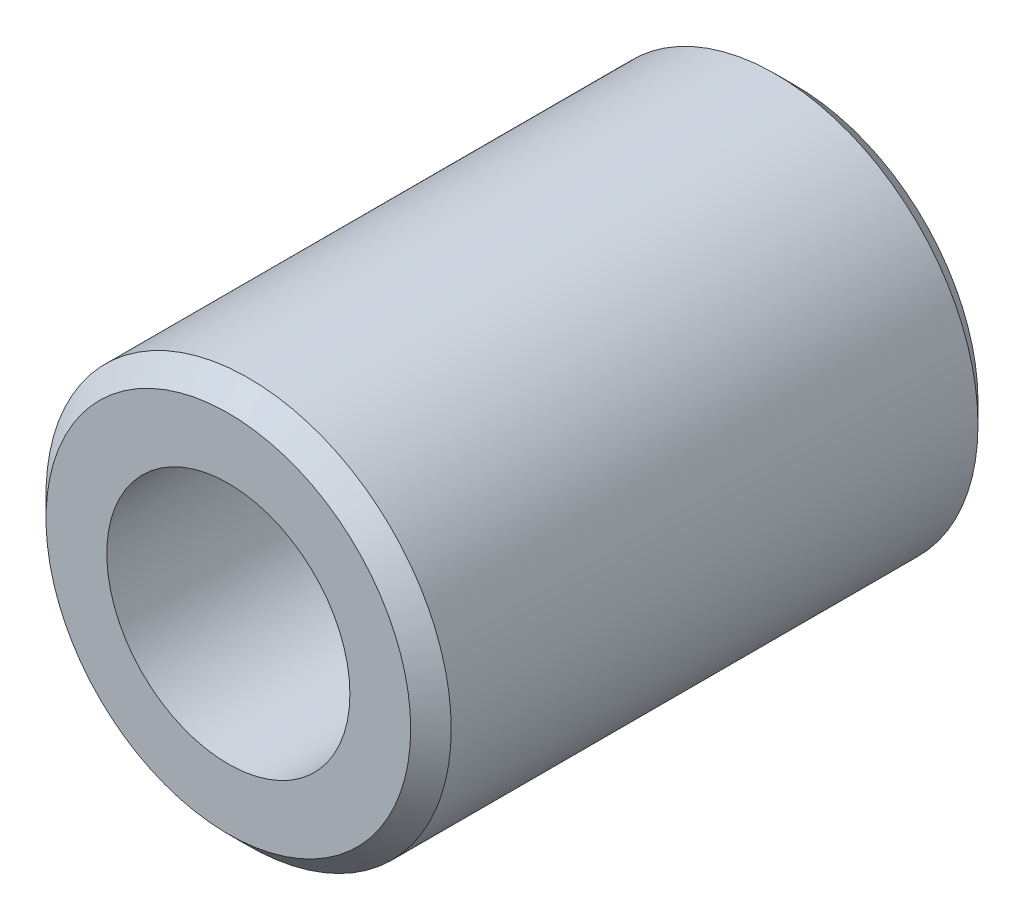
ISO-10303-21;
HEADER;
FILE_DESCRIPTION(('STEP AP214'),'2;1');
FILE_NAME('part.step','',(''),(''),'','','');
FILE_SCHEMA(('AUTOMOTIVE_DESIGN { 1 0 10303 214 1 1 1 1 }'));
ENDSEC;
DATA;
#1=APPLICATION_CONTEXT('core data for automotive mechanical design processes');
#2=APPLICATION_PROTOCOL_DEFINITION('international standard','automotive_design',2000,#1);
#3=PRODUCT_CONTEXT('',#1,'mechanical');
#4=PRODUCT('Part','Part','',(#3));
#5=PRODUCT_RELATED_PRODUCT_CATEGORY('part','',(#4));
#6=PRODUCT_DEFINITION_FORMATION('','',#4);
#7=PRODUCT_DEFINITION_CONTEXT('part definition',#1,'design');
#8=PRODUCT_DEFINITION('design','',#6,#7);
#9=PRODUCT_DEFINITION_SHAPE('','',#8);
#10=(LENGTH_UNIT() NAMED_UNIT(*) SI_UNIT(.MILLI.,.METRE.));
#11=(NAMED_UNIT(*) PLANE_ANGLE_UNIT() SI_UNIT($,.RADIAN.));
#12=(NAMED_UNIT(*) SI_UNIT($,.STERADIAN.) SOLID_ANGLE_UNIT());
#13=UNCERTAINTY_MEASURE_WITH_UNIT(LENGTH_MEASURE(1.E-05),#10,'distance_accuracy_value','');
#14=(GEOMETRIC_REPRESENTATION_CONTEXT(3) GLOBAL_UNCERTAINTY_ASSIGNED_CONTEXT((#13)) GLOBAL_UNIT_ASSIGNED_CONTEXT((#10,
#11,#12)) REPRESENTATION_CONTEXT('',''));
#15=CARTESIAN_POINT('',(0.,0.,0.));
#16=DIRECTION('',(0.,0.,1.));
#17=DIRECTION('',(1.,0.,0.));
#18=AXIS2_PLACEMENT_3D('',#15,#16,#17);
#19=CARTESIAN_POINT('',(-14.75,36.,3.5));
#20=DIRECTION('',(0.,0.,1.));
#21=DIRECTION('',(1.,0.,0.));
#22=AXIS2_PLACEMENT_3D('',#19,#20,#21);
#23=PLANE('',#22);
#24=CARTESIAN_POINT('',(-14.75,36.,3.5));
#25=DIRECTION('',(0.,0.,1.));
#26=DIRECTION('',(1.,0.,0.));
#27=AXIS2_PLACEMENT_3D('',#24,#25,#26);
#28=CIRCLE('',#27,2.25);
#29=CARTESIAN_POINT('',(-12.5,36.,3.5));
#30=VERTEX_POINT('',#29);
#31=EDGE_CURVE('E43',#30,#30,#28,.T.);
#32=ORIENTED_EDGE('',*,*,#31,.T.);
#33=EDGE_LOOP('',(#32));
#34=FACE_BOUND('',#33,.T.);
#35=CARTESIAN_POINT('',(-14.75,36.,3.5));
#36=DIRECTION('',(0.,0.,1.));
#37=DIRECTION('',(1.,0.,0.));
#38=AXIS2_PLACEMENT_3D('',#35,#36,#37);
#39=CIRCLE('',#38,1.5);
#40=CARTESIAN_POINT('',(-13.25,36.,3.5));
#41=VERTEX_POINT('',#40);
#42=EDGE_CURVE('E48',#41,#41,#39,.T.);
#43=ORIENTED_EDGE('',*,*,#42,.F.);
#44=EDGE_LOOP('',(#43));
#45=FACE_BOUND('',#44,.T.);
#46=ADVANCED_FACE('F28',(#34,#45),#23,.T.);
#47=CARTESIAN_POINT('',(-14.75,36.,3.5));
#48=DIRECTION('',(0.,0.,-1.));
#49=DIRECTION('',(-1.,0.,0.));
#50=AXIS2_PLACEMENT_3D('',#47,#48,#49);
#51=CYLINDRICAL_SURFACE('',#50,2.5);
#52=CARTESIAN_POINT('',(-14.75,36.,3.25));
#53=DIRECTION('',(0.,0.,1.));
#54=DIRECTION('',(1.,0.,0.));
#55=AXIS2_PLACEMENT_3D('',#52,#53,#54);
#56=CIRCLE('',#55,2.5);
#57=CARTESIAN_POINT('',(-12.25,36.,3.25));
#58=VERTEX_POINT('',#57);
#59=EDGE_CURVE('E35',#58,#58,#56,.F.);
#60=ORIENTED_EDGE('',*,*,#59,.T.);
#61=EDGE_LOOP('',(#60));
#62=FACE_BOUND('',#61,.T.);
#63=CARTESIAN_POINT('',(-14.75,36.,-3.25));
#64=DIRECTION('',(0.,0.,1.));
#65=DIRECTION('',(1.,0.,0.));
#66=AXIS2_PLACEMENT_3D('',#63,#64,#65);
#67=CIRCLE('',#66,2.5);
#68=CARTESIAN_POINT('',(-12.25,36.,-3.25));
#69=VERTEX_POINT('',#68);
#70=EDGE_CURVE('E39',#69,#69,#67,.T.);
#71=ORIENTED_EDGE('',*,*,#70,.T.);
#72=EDGE_LOOP('',(#71));
#73=FACE_BOUND('',#72,.T.);
#74=ADVANCED_FACE('F30',(#62,#73),#51,.T.);
#75=CARTESIAN_POINT('',(-14.75,36.,3.5));
#76=DIRECTION('',(0.,0.,-1.));
#77=DIRECTION('',(-1.,0.,0.));
#78=AXIS2_PLACEMENT_3D('',#75,#76,#77);
#79=CYLINDRICAL_SURFACE('',#78,1.5);
#80=ORIENTED_EDGE('',*,*,#42,.T.);
#81=EDGE_LOOP('',(#80));
#82=FACE_BOUND('',#81,.T.);
#83=CARTESIAN_POINT('',(-14.75,36.,-3.5));
#84=DIRECTION('',(0.,0.,1.));
#85=DIRECTION('',(1.,0.,0.));
#86=AXIS2_PLACEMENT_3D('',#83,#84,#85);
#87=CIRCLE('',#86,1.5);
#88=CARTESIAN_POINT('',(-13.25,36.,-3.5));
#89=VERTEX_POINT('',#88);
#90=EDGE_CURVE('E51',#89,#89,#87,.T.);
#91=ORIENTED_EDGE('',*,*,#90,.F.);
#92=EDGE_LOOP('',(#91));
#93=FACE_BOUND('',#92,.T.);
#94=ADVANCED_FACE('F57',(#82,#93),#79,.F.);
#95=CARTESIAN_POINT('',(-14.75,36.,-3.5));
#96=DIRECTION('',(0.,0.,1.));
#97=DIRECTION('',(1.,0.,0.));
#98=AXIS2_PLACEMENT_3D('',#95,#96,#97);
#99=PLANE('',#98);
#100=CARTESIAN_POINT('',(-14.75,36.,-3.5));
#101=DIRECTION('',(0.,0.,1.));
#102=DIRECTION('',(1.,0.,0.));
#103=AXIS2_PLACEMENT_3D('',#100,#101,#102);
#104=CIRCLE('',#103,2.25);
#105=CARTESIAN_POINT('',(-12.5,36.,-3.5));
#106=VERTEX_POINT('',#105);
#107=EDGE_CURVE('E10',#106,#106,#104,.F.);
#108=ORIENTED_EDGE('',*,*,#107,.T.);
#109=EDGE_LOOP('',(#108));
#110=FACE_BOUND('',#109,.T.);
#111=ORIENTED_EDGE('',*,*,#90,.T.);
#112=EDGE_LOOP('',(#111));
#113=FACE_BOUND('',#112,.T.);
#114=ADVANCED_FACE('F55',(#110,#113),#99,.F.);
#115=CARTESIAN_POINT('',(-14.75,36.,3.5));
#116=DIRECTION('',(0.,0.,-1.));
#117=DIRECTION('',(-1.,0.,0.));
#118=AXIS2_PLACEMENT_3D('',#115,#116,#117);
#119=CONICAL_SURFACE('',#118,2.25,0.785398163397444);
#120=ORIENTED_EDGE('',*,*,#59,.F.);
#121=EDGE_LOOP('',(#120));
#122=FACE_BOUND('',#121,.T.);
#123=ORIENTED_EDGE('',*,*,#31,.F.);
#124=EDGE_LOOP('',(#123));
#125=FACE_BOUND('',#124,.T.);
#126=ADVANCED_FACE('F65',(#122,#125),#119,.T.);
#127=CARTESIAN_POINT('',(-14.75,36.,-3.25));
#128=DIRECTION('',(0.,0.,1.));
#129=DIRECTION('',(1.,0.,0.));
#130=AXIS2_PLACEMENT_3D('',#127,#128,#129);
#131=CONICAL_SURFACE('',#130,2.5,0.785398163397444);
#132=ORIENTED_EDGE('',*,*,#107,.F.);
#133=EDGE_LOOP('',(#132));
#134=FACE_BOUND('',#133,.T.);
#135=ORIENTED_EDGE('',*,*,#70,.F.);
#136=EDGE_LOOP('',(#135));
#137=FACE_BOUND('',#136,.T.);
#138=ADVANCED_FACE('F76',(#134,#137),#131,.T.);
#139=CLOSED_SHELL('',(#46,#74,#94,#114,#126,#138));
#140=MANIFOLD_SOLID_BREP('B2',#139);
#141=ADVANCED_BREP_SHAPE_REPRESENTATION('',(#18,#140),#14);
#142=SHAPE_DEFINITION_REPRESENTATION(#9,#141);
ENDSEC;
END-ISO-10303-21;
